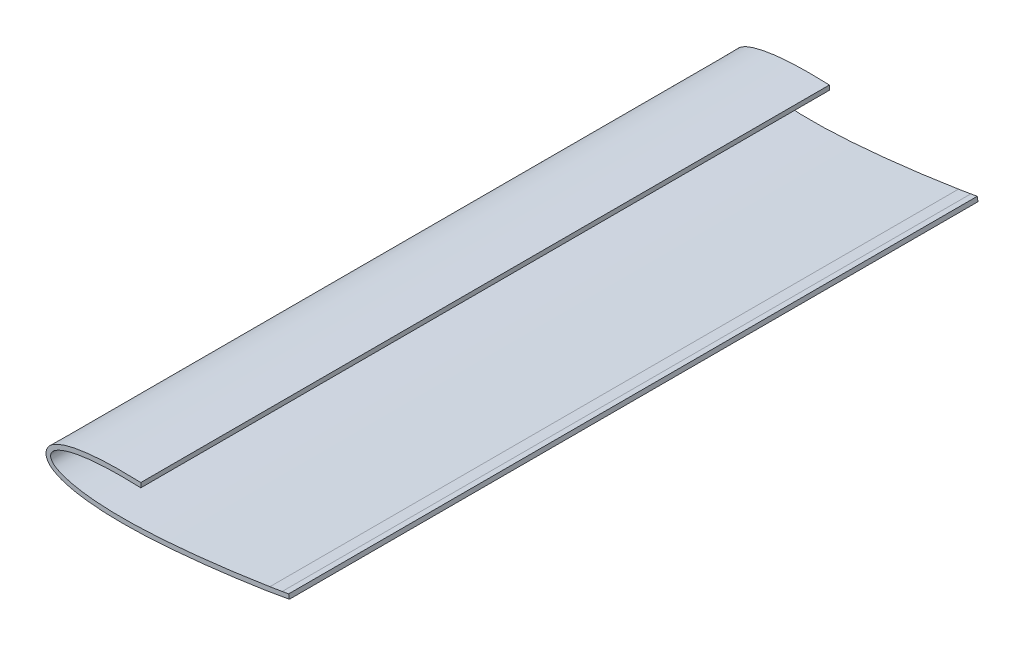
ISO-10303-21;
HEADER;
FILE_DESCRIPTION(('STEP AP214'),'2;1');
FILE_NAME('part.step','',(''),(''),'','','');
FILE_SCHEMA(('AUTOMOTIVE_DESIGN { 1 0 10303 214 1 1 1 1 }'));
ENDSEC;
DATA;
#1=APPLICATION_CONTEXT('core data for automotive mechanical design processes');
#2=APPLICATION_PROTOCOL_DEFINITION('international standard','automotive_design',2000,#1);
#3=PRODUCT_CONTEXT('',#1,'mechanical');
#4=PRODUCT('Part','Part','',(#3));
#5=PRODUCT_RELATED_PRODUCT_CATEGORY('part','',(#4));
#6=PRODUCT_DEFINITION_FORMATION('','',#4);
#7=PRODUCT_DEFINITION_CONTEXT('part definition',#1,'design');
#8=PRODUCT_DEFINITION('design','',#6,#7);
#9=PRODUCT_DEFINITION_SHAPE('','',#8);
#10=(LENGTH_UNIT() NAMED_UNIT(*) SI_UNIT(.MILLI.,.METRE.));
#11=(NAMED_UNIT(*) PLANE_ANGLE_UNIT() SI_UNIT($,.RADIAN.));
#12=(NAMED_UNIT(*) SI_UNIT($,.STERADIAN.) SOLID_ANGLE_UNIT());
#13=UNCERTAINTY_MEASURE_WITH_UNIT(LENGTH_MEASURE(1.E-05),#10,'distance_accuracy_value','');
#14=(GEOMETRIC_REPRESENTATION_CONTEXT(3) GLOBAL_UNCERTAINTY_ASSIGNED_CONTEXT((#13)) GLOBAL_UNIT_ASSIGNED_CONTEXT((#10,
#11,#12)) REPRESENTATION_CONTEXT('',''));
#15=CARTESIAN_POINT('',(0.,0.,0.));
#16=DIRECTION('',(0.,0.,1.));
#17=DIRECTION('',(1.,0.,0.));
#18=AXIS2_PLACEMENT_3D('',#15,#16,#17);
#19=CARTESIAN_POINT('',(51.8585690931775,-1.14149612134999,300.));
#20=CARTESIAN_POINT('',(50.9270444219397,-1.30175657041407,300.));
#21=CARTESIAN_POINT('',(49.9955197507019,-1.46201701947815,300.));
#22=CARTESIAN_POINT('',(49.0637056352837,-1.6205437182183,300.));
#23=B_SPLINE_CURVE_WITH_KNOTS('',3,(#19,#20,#21,#22),.UNSPECIFIED.,.F.,.F.,(4,4),
(0.986199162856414,1.),.UNSPECIFIED.);
#24=DIRECTION('',(0.,0.,-1.));
#25=VECTOR('',#24,1.);
#26=SURFACE_OF_LINEAR_EXTRUSION('',#23,#25);
#27=CARTESIAN_POINT('',(51.8585690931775,-1.14149612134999,0.));
#28=CARTESIAN_POINT('',(50.9270444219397,-1.30175657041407,0.));
#29=CARTESIAN_POINT('',(49.9955197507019,-1.46201701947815,0.));
#30=CARTESIAN_POINT('',(49.0637056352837,-1.6205437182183,0.));
#31=B_SPLINE_CURVE_WITH_KNOTS('',3,(#27,#28,#29,#30),.UNSPECIFIED.,.F.,.F.,(4,4),
(0.986199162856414,1.),.UNSPECIFIED.);
#32=CARTESIAN_POINT('',(51.8585690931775,-1.14149612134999,0.));
#33=VERTEX_POINT('',#32);
#34=CARTESIAN_POINT('',(49.0637056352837,-1.6205437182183,0.));
#35=VERTEX_POINT('',#34);
#36=EDGE_CURVE('E142',#33,#35,#31,.T.);
#37=ORIENTED_EDGE('',*,*,#36,.T.);
#38=DIRECTION('',(0.,0.,-1.));
#39=VECTOR('',#38,1.);
#40=CARTESIAN_POINT('',(49.0637056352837,-1.6205437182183,300.));
#41=LINE('',#40,#39);
#42=CARTESIAN_POINT('',(49.0637056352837,-1.6205437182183,300.));
#43=VERTEX_POINT('',#42);
#44=EDGE_CURVE('E11',#43,#35,#41,.T.);
#45=ORIENTED_EDGE('',*,*,#44,.F.);
#46=CARTESIAN_POINT('',(51.8585690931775,-1.14149612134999,300.));
#47=VERTEX_POINT('',#46);
#48=EDGE_CURVE('E176',#47,#43,#23,.T.);
#49=ORIENTED_EDGE('',*,*,#48,.F.);
#50=DIRECTION('',(0.,0.,-1.));
#51=VECTOR('',#50,1.);
#52=CARTESIAN_POINT('',(51.8585690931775,-1.14149612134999,300.));
#53=LINE('',#52,#51);
#54=EDGE_CURVE('E135',#47,#33,#53,.T.);
#55=ORIENTED_EDGE('',*,*,#54,.T.);
#56=EDGE_LOOP('',(#37,#45,#49,#55));
#57=FACE_BOUND('',#56,.T.);
#58=ADVANCED_FACE('F43',(#57),#26,.F.);
#59=CARTESIAN_POINT('',(43.6918589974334,-2.51831191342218,300.));
#60=DIRECTION('',(0.164838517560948,-0.986320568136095,0.));
#61=DIRECTION('',(0.986320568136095,0.164838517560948,0.));
#62=AXIS2_PLACEMENT_3D('',#59,#60,#61);
#63=PLANE('',#62);
#64=DIRECTION('',(-0.986320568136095,-0.164838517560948,0.));
#65=VECTOR('',#64,1.);
#66=CARTESIAN_POINT('',(43.6918589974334,-2.51831191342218,0.));
#67=LINE('',#66,#65);
#68=CARTESIAN_POINT('',(43.6918589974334,-2.51831191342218,0.));
#69=VERTEX_POINT('',#68);
#70=EDGE_CURVE('E148',#35,#69,#67,.T.);
#71=ORIENTED_EDGE('',*,*,#70,.T.);
#72=DIRECTION('',(0.,0.,-1.));
#73=VECTOR('',#72,1.);
#74=CARTESIAN_POINT('',(43.6918589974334,-2.51831191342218,300.));
#75=LINE('',#74,#73);
#76=CARTESIAN_POINT('',(43.6918589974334,-2.51831191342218,300.));
#77=VERTEX_POINT('',#76);
#78=EDGE_CURVE('E53',#77,#69,#75,.T.);
#79=ORIENTED_EDGE('',*,*,#78,.F.);
#80=DIRECTION('',(-0.986320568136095,-0.164838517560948,0.));
#81=VECTOR('',#80,1.);
#82=CARTESIAN_POINT('',(43.6918589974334,-2.51831191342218,300.));
#83=LINE('',#82,#81);
#84=EDGE_CURVE('E101',#43,#77,#83,.T.);
#85=ORIENTED_EDGE('',*,*,#84,.F.);
#86=ORIENTED_EDGE('',*,*,#44,.T.);
#87=EDGE_LOOP('',(#71,#79,#85,#86));
#88=FACE_BOUND('',#87,.T.);
#89=ADVANCED_FACE('F213',(#88),#63,.F.);
#90=CARTESIAN_POINT('',(43.6918589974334,-2.51831191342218,300.));
#91=CARTESIAN_POINT('',(42.907813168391,-2.64257177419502,300.));
#92=CARTESIAN_POINT('',(38.6766738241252,-3.30325789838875,300.));
#93=CARTESIAN_POINT('',(30.9942527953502,-4.42091125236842,300.));
#94=CARTESIAN_POINT('',(20.6372229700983,-5.7564913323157,300.));
#95=CARTESIAN_POINT('',(10.2814223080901,-6.91328903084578,300.));
#96=CARTESIAN_POINT('',(-0.0742210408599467,-7.85637844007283,300.));
#97=CARTESIAN_POINT('',(-10.431156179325,-8.52257003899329,300.));
#98=CARTESIAN_POINT('',(-19.0686102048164,-8.75077508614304,300.));
#99=CARTESIAN_POINT('',(-25.9753727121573,-8.64786912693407,300.));
#100=CARTESIAN_POINT('',(-31.1580682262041,-8.38518277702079,300.));
#101=CARTESIAN_POINT('',(-36.34756616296,-7.88575404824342,300.));
#102=CARTESIAN_POINT('',(-40.6676166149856,-7.19025575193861,300.));
#103=CARTESIAN_POINT('',(-44.1173996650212,-6.36538393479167,300.));
#104=CARTESIAN_POINT('',(-46.736461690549,-5.53926156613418,300.));
#105=CARTESIAN_POINT('',(-48.9378918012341,-4.53784179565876,300.));
#106=CARTESIAN_POINT('',(-50.9134717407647,-3.21390421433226,300.));
#107=CARTESIAN_POINT('',(-52.4443571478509,-0.893371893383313,300.));
#108=CARTESIAN_POINT('',(-50.9076140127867,1.42328537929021,300.));
#109=CARTESIAN_POINT('',(-48.9286955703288,2.74222761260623,300.));
#110=CARTESIAN_POINT('',(-46.7247424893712,3.73808247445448,300.));
#111=CARTESIAN_POINT('',(-44.1036016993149,4.55758538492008,300.));
#112=CARTESIAN_POINT('',(-40.6517456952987,5.37373900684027,300.));
#113=CARTESIAN_POINT('',(-36.3299519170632,6.05832086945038,300.));
#114=CARTESIAN_POINT('',(-31.1392087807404,6.5446372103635,300.));
#115=CARTESIAN_POINT('',(-25.9558661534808,6.7942291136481,300.));
#116=CARTESIAN_POINT('',(-19.757568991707,6.87091706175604,300.));
#117=CARTESIAN_POINT('',(-15.2877383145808,6.76679805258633,300.));
#118=CARTESIAN_POINT('',(-12.545664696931,6.65784748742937,300.));
#119=B_SPLINE_CURVE_WITH_KNOTS('',3,(#90,#91,#92,#93,#94,#95,#96,#97,#98,#99,#100,#101,#102,
#103,#104,#105,#106,#107,#108,#109,#110,#111,#112,#113,#114,#115,#116,#117,#118),.UNSPECIFIED.,
.F.,.F.,(4,1,1,1,1,1,1,1,1,1,1,1,1,1,1,1,1,1,1,1,1,1,1,1,1,1,4),(0.304211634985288,
0.315405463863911,0.36459757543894,0.413677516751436,0.462653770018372,0.511525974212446,
0.560294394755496,0.608979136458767,0.633316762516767,0.657683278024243,0.682134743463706,
0.706801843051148,0.719318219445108,0.732103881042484,0.74554821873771,0.753047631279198,
0.766075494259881,0.779103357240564,0.786602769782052,0.800047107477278,0.812832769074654,
0.825349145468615,0.850016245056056,0.874467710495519,0.898834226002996,0.923171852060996,
0.961863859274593),.UNSPECIFIED.);
#120=DIRECTION('',(0.,0.,-1.));
#121=VECTOR('',#120,1.);
#122=SURFACE_OF_LINEAR_EXTRUSION('',#119,#121);
#123=CARTESIAN_POINT('',(43.6918589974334,-2.51831191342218,0.));
#124=CARTESIAN_POINT('',(42.907813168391,-2.64257177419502,0.));
#125=CARTESIAN_POINT('',(38.6766738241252,-3.30325789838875,0.));
#126=CARTESIAN_POINT('',(30.9942527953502,-4.42091125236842,0.));
#127=CARTESIAN_POINT('',(20.6372229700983,-5.7564913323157,0.));
#128=CARTESIAN_POINT('',(10.2814223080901,-6.91328903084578,0.));
#129=CARTESIAN_POINT('',(-0.0742210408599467,-7.85637844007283,0.));
#130=CARTESIAN_POINT('',(-10.431156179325,-8.52257003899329,0.));
#131=CARTESIAN_POINT('',(-19.0686102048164,-8.75077508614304,0.));
#132=CARTESIAN_POINT('',(-25.9753727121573,-8.64786912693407,0.));
#133=CARTESIAN_POINT('',(-31.1580682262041,-8.38518277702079,0.));
#134=CARTESIAN_POINT('',(-36.34756616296,-7.88575404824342,0.));
#135=CARTESIAN_POINT('',(-40.6676166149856,-7.19025575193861,0.));
#136=CARTESIAN_POINT('',(-44.1173996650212,-6.36538393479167,0.));
#137=CARTESIAN_POINT('',(-46.736461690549,-5.53926156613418,0.));
#138=CARTESIAN_POINT('',(-48.9378918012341,-4.53784179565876,0.));
#139=CARTESIAN_POINT('',(-50.9134717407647,-3.21390421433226,0.));
#140=CARTESIAN_POINT('',(-52.4443571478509,-0.893371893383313,0.));
#141=CARTESIAN_POINT('',(-50.9076140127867,1.42328537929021,0.));
#142=CARTESIAN_POINT('',(-48.9286955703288,2.74222761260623,0.));
#143=CARTESIAN_POINT('',(-46.7247424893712,3.73808247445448,0.));
#144=CARTESIAN_POINT('',(-44.1036016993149,4.55758538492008,0.));
#145=CARTESIAN_POINT('',(-40.6517456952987,5.37373900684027,0.));
#146=CARTESIAN_POINT('',(-36.3299519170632,6.05832086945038,0.));
#147=CARTESIAN_POINT('',(-31.1392087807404,6.5446372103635,0.));
#148=CARTESIAN_POINT('',(-25.9558661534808,6.7942291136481,0.));
#149=CARTESIAN_POINT('',(-19.757568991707,6.87091706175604,0.));
#150=CARTESIAN_POINT('',(-15.2877383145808,6.76679805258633,0.));
#151=CARTESIAN_POINT('',(-12.545664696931,6.65784748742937,0.));
#152=B_SPLINE_CURVE_WITH_KNOTS('',3,(#123,#124,#125,#126,#127,#128,#129,#130,#131,#132,#133,
#134,#135,#136,#137,#138,#139,#140,#141,#142,#143,#144,#145,#146,#147,#148,#149,#150,#151),
.UNSPECIFIED.,.F.,.F.,(4,1,1,1,1,1,1,1,1,1,1,1,1,1,1,1,1,1,1,1,1,1,1,1,1,1,4),
(0.304211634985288,0.315405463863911,0.36459757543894,0.413677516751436,0.462653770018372,
0.511525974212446,0.560294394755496,0.608979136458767,0.633316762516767,0.657683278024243,
0.682134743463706,0.706801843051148,0.719318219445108,0.732103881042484,0.74554821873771,
0.753047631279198,0.766075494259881,0.779103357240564,0.786602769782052,0.800047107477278,
0.812832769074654,0.825349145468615,0.850016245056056,0.874467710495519,0.898834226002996,
0.923171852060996,0.961863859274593),.UNSPECIFIED.);
#153=CARTESIAN_POINT('',(-12.545664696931,6.65784748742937,0.));
#154=VERTEX_POINT('',#153);
#155=EDGE_CURVE('E154',#69,#154,#152,.T.);
#156=ORIENTED_EDGE('',*,*,#155,.T.);
#157=DIRECTION('',(0.,0.,-1.));
#158=VECTOR('',#157,1.);
#159=CARTESIAN_POINT('',(-12.545664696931,6.65784748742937,300.));
#160=LINE('',#159,#158);
#161=CARTESIAN_POINT('',(-12.545664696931,6.65784748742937,300.));
#162=VERTEX_POINT('',#161);
#163=EDGE_CURVE('E183',#162,#154,#160,.T.);
#164=ORIENTED_EDGE('',*,*,#163,.F.);
#165=EDGE_CURVE('E193',#77,#162,#119,.T.);
#166=ORIENTED_EDGE('',*,*,#165,.F.);
#167=ORIENTED_EDGE('',*,*,#78,.T.);
#168=EDGE_LOOP('',(#156,#164,#166,#167));
#169=FACE_BOUND('',#168,.T.);
#170=ADVANCED_FACE('F191',(#169),#122,.F.);
#171=CARTESIAN_POINT('',(-12.545664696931,8.65932731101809,300.));
#172=DIRECTION('',(-1.,0.,0.));
#173=DIRECTION('',(0.,-1.,0.));
#174=AXIS2_PLACEMENT_3D('',#171,#172,#173);
#175=PLANE('',#174);
#176=DIRECTION('',(0.,1.,0.));
#177=VECTOR('',#176,1.);
#178=CARTESIAN_POINT('',(-12.545664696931,8.65932731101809,0.));
#179=LINE('',#178,#177);
#180=CARTESIAN_POINT('',(-12.545664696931,8.65932731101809,0.));
#181=VERTEX_POINT('',#180);
#182=EDGE_CURVE('E159',#154,#181,#179,.T.);
#183=ORIENTED_EDGE('',*,*,#182,.T.);
#184=DIRECTION('',(0.,0.,-1.));
#185=VECTOR('',#184,1.);
#186=CARTESIAN_POINT('',(-12.545664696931,8.65932731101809,300.));
#187=LINE('',#186,#185);
#188=CARTESIAN_POINT('',(-12.545664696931,8.65932731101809,300.));
#189=VERTEX_POINT('',#188);
#190=EDGE_CURVE('E128',#189,#181,#187,.T.);
#191=ORIENTED_EDGE('',*,*,#190,.F.);
#192=DIRECTION('',(0.,1.,0.));
#193=VECTOR('',#192,1.);
#194=CARTESIAN_POINT('',(-12.545664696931,8.65932731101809,300.));
#195=LINE('',#194,#193);
#196=EDGE_CURVE('E117',#162,#189,#195,.T.);
#197=ORIENTED_EDGE('',*,*,#196,.F.);
#198=ORIENTED_EDGE('',*,*,#163,.T.);
#199=EDGE_LOOP('',(#183,#191,#197,#198));
#200=FACE_BOUND('',#199,.T.);
#201=ADVANCED_FACE('F199',(#200),#175,.F.);
#202=CARTESIAN_POINT('',(-12.545664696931,8.65932731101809,300.));
#203=CARTESIAN_POINT('',(-14.2008130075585,8.72447684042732,300.));
#204=CARTESIAN_POINT('',(-17.985890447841,8.83621686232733,300.));
#205=CARTESIAN_POINT('',(-23.9117300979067,8.85326734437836,300.));
#206=CARTESIAN_POINT('',(-29.2612463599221,8.65942643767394,300.));
#207=CARTESIAN_POINT('',(-33.5466478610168,8.33343930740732,300.));
#208=CARTESIAN_POINT('',(-36.763835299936,7.98484981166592,300.));
#209=CARTESIAN_POINT('',(-39.9863348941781,7.50640839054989,300.));
#210=CARTESIAN_POINT('',(-42.6696695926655,6.96537419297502,300.));
#211=CARTESIAN_POINT('',(-44.811837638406,6.41638808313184,300.));
#212=CARTESIAN_POINT('',(-46.4242178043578,5.92712025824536,300.));
#213=CARTESIAN_POINT('',(-48.0377292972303,5.33212552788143,300.));
#214=CARTESIAN_POINT('',(-49.3867932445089,4.70973377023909,300.));
#215=CARTESIAN_POINT('',(-50.4203016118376,4.13279790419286,300.));
#216=CARTESIAN_POINT('',(-51.2375690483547,3.60556687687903,300.));
#217=CARTESIAN_POINT('',(-52.0795866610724,2.90140860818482,300.));
#218=CARTESIAN_POINT('',(-52.8513105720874,2.02109238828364,300.));
#219=CARTESIAN_POINT('',(-53.4943493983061,0.946512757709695,300.));
#220=CARTESIAN_POINT('',(-53.8354526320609,-0.156378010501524,300.));
#221=CARTESIAN_POINT('',(-53.8623110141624,-1.18469757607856,300.));
#222=CARTESIAN_POINT('',(-53.7050356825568,-2.14033578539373,300.));
#223=CARTESIAN_POINT('',(-53.2779664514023,-3.16288234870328,300.));
#224=CARTESIAN_POINT('',(-52.5810991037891,-4.15858766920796,300.));
#225=CARTESIAN_POINT('',(-51.7757791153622,-4.97816858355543,300.));
#226=CARTESIAN_POINT('',(-50.9333871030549,-5.6128643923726,300.));
#227=CARTESIAN_POINT('',(-49.8834886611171,-6.25107683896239,300.));
#228=CARTESIAN_POINT('',(-48.5615915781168,-6.91300232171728,300.));
#229=CARTESIAN_POINT('',(-46.9432625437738,-7.55531978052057,300.));
#230=CARTESIAN_POINT('',(-45.3314114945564,-8.07845563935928,300.));
#231=CARTESIAN_POINT('',(-43.1907788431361,-8.66078339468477,300.));
#232=CARTESIAN_POINT('',(-40.5096578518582,-9.23434662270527,300.));
#233=CARTESIAN_POINT('',(-37.2877811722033,-9.744936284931,300.));
#234=CARTESIAN_POINT('',(-34.0713679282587,-10.1196491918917,300.));
#235=CARTESIAN_POINT('',(-30.8570446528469,-10.3870656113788,300.));
#236=CARTESIAN_POINT('',(-26.5757641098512,-10.626798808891,300.));
#237=CARTESIAN_POINT('',(-21.2336176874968,-10.7368539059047,300.));
#238=CARTESIAN_POINT('',(-14.8422870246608,-10.6494176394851,300.));
#239=CARTESIAN_POINT('',(-8.4674130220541,-10.3869492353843,300.));
#240=CARTESIAN_POINT('',(-2.11000024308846,-9.98675648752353,300.));
#241=CARTESIAN_POINT('',(6.34532174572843,-9.30521888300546,300.));
#242=CARTESIAN_POINT('',(16.8828224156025,-8.22559608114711,300.));
#243=CARTESIAN_POINT('',(29.4863919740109,-6.65724245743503,300.));
#244=CARTESIAN_POINT('',(37.8675333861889,-5.44756872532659,300.));
#245=CARTESIAN_POINT('',(42.0512425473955,-4.79966867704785,300.));
#246=B_SPLINE_CURVE_WITH_KNOTS('',3,(#202,#203,#204,#205,#206,#207,#208,#209,#210,#211,#212,
#213,#214,#215,#216,#217,#218,#219,#220,#221,#222,#223,#224,#225,#226,#227,#228,#229,#230,#231,
#232,#233,#234,#235,#236,#237,#238,#239,#240,#241,#242,#243,#244,#245),.UNSPECIFIED.,.F.,.F.,(4,
1,1,1,1,1,1,1,1,1,1,1,1,1,1,1,1,1,1,1,1,1,1,1,1,1,1,1,1,1,1,1,1,1,1,1,1,1,1,1,1,4),
(0.304581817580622,0.32775025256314,0.357505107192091,0.387259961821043,0.402137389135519,
0.417014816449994,0.43189224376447,0.446769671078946,0.454208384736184,0.461647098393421,
0.469085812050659,0.476524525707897,0.480243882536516,0.483963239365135,0.487682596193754,
0.491401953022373,0.495121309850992,0.498840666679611,0.50070034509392,0.50256002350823,
0.506279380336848,0.509998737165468,0.513718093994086,0.517437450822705,0.521156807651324,
0.528595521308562,0.5360342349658,0.543472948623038,0.550911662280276,0.565789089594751,
0.580666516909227,0.595543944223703,0.610421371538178,0.625298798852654,0.655053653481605,
0.684808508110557,0.714563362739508,0.74431821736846,0.774073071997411,0.833582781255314,
0.893092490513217,0.952602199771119),.UNSPECIFIED.);
#247=DIRECTION('',(0.,0.,-1.));
#248=VECTOR('',#247,1.);
#249=SURFACE_OF_LINEAR_EXTRUSION('',#246,#248);
#250=CARTESIAN_POINT('',(-12.545664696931,8.65932731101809,0.));
#251=CARTESIAN_POINT('',(-14.2008130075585,8.72447684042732,0.));
#252=CARTESIAN_POINT('',(-17.985890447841,8.83621686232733,0.));
#253=CARTESIAN_POINT('',(-23.9117300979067,8.85326734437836,0.));
#254=CARTESIAN_POINT('',(-29.2612463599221,8.65942643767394,0.));
#255=CARTESIAN_POINT('',(-33.5466478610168,8.33343930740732,0.));
#256=CARTESIAN_POINT('',(-36.763835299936,7.98484981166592,0.));
#257=CARTESIAN_POINT('',(-39.9863348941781,7.50640839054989,0.));
#258=CARTESIAN_POINT('',(-42.6696695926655,6.96537419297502,0.));
#259=CARTESIAN_POINT('',(-44.811837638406,6.41638808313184,0.));
#260=CARTESIAN_POINT('',(-46.4242178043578,5.92712025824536,0.));
#261=CARTESIAN_POINT('',(-48.0377292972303,5.33212552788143,0.));
#262=CARTESIAN_POINT('',(-49.3867932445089,4.70973377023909,0.));
#263=CARTESIAN_POINT('',(-50.4203016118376,4.13279790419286,0.));
#264=CARTESIAN_POINT('',(-51.2375690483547,3.60556687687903,0.));
#265=CARTESIAN_POINT('',(-52.0795866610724,2.90140860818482,0.));
#266=CARTESIAN_POINT('',(-52.8513105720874,2.02109238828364,0.));
#267=CARTESIAN_POINT('',(-53.4943493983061,0.946512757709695,0.));
#268=CARTESIAN_POINT('',(-53.8354526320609,-0.156378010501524,0.));
#269=CARTESIAN_POINT('',(-53.8623110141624,-1.18469757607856,0.));
#270=CARTESIAN_POINT('',(-53.7050356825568,-2.14033578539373,0.));
#271=CARTESIAN_POINT('',(-53.2779664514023,-3.16288234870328,0.));
#272=CARTESIAN_POINT('',(-52.5810991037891,-4.15858766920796,0.));
#273=CARTESIAN_POINT('',(-51.7757791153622,-4.97816858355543,0.));
#274=CARTESIAN_POINT('',(-50.9333871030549,-5.6128643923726,0.));
#275=CARTESIAN_POINT('',(-49.8834886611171,-6.25107683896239,0.));
#276=CARTESIAN_POINT('',(-48.5615915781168,-6.91300232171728,0.));
#277=CARTESIAN_POINT('',(-46.9432625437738,-7.55531978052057,0.));
#278=CARTESIAN_POINT('',(-45.3314114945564,-8.07845563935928,0.));
#279=CARTESIAN_POINT('',(-43.1907788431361,-8.66078339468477,0.));
#280=CARTESIAN_POINT('',(-40.5096578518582,-9.23434662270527,0.));
#281=CARTESIAN_POINT('',(-37.2877811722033,-9.744936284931,0.));
#282=CARTESIAN_POINT('',(-34.0713679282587,-10.1196491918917,0.));
#283=CARTESIAN_POINT('',(-30.8570446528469,-10.3870656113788,0.));
#284=CARTESIAN_POINT('',(-26.5757641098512,-10.626798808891,0.));
#285=CARTESIAN_POINT('',(-21.2336176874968,-10.7368539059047,0.));
#286=CARTESIAN_POINT('',(-14.8422870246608,-10.6494176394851,0.));
#287=CARTESIAN_POINT('',(-8.4674130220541,-10.3869492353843,0.));
#288=CARTESIAN_POINT('',(-2.11000024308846,-9.98675648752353,0.));
#289=CARTESIAN_POINT('',(6.34532174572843,-9.30521888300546,0.));
#290=CARTESIAN_POINT('',(16.8828224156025,-8.22559608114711,0.));
#291=CARTESIAN_POINT('',(29.4863919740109,-6.65724245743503,0.));
#292=CARTESIAN_POINT('',(37.8675333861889,-5.44756872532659,0.));
#293=CARTESIAN_POINT('',(42.0512425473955,-4.79966867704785,0.));
#294=B_SPLINE_CURVE_WITH_KNOTS('',3,(#250,#251,#252,#253,#254,#255,#256,#257,#258,#259,#260,
#261,#262,#263,#264,#265,#266,#267,#268,#269,#270,#271,#272,#273,#274,#275,#276,#277,#278,#279,
#280,#281,#282,#283,#284,#285,#286,#287,#288,#289,#290,#291,#292,#293),.UNSPECIFIED.,.F.,.F.,(4,
1,1,1,1,1,1,1,1,1,1,1,1,1,1,1,1,1,1,1,1,1,1,1,1,1,1,1,1,1,1,1,1,1,1,1,1,1,1,1,1,4),
(0.304581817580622,0.32775025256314,0.357505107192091,0.387259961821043,0.402137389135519,
0.417014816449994,0.43189224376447,0.446769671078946,0.454208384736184,0.461647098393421,
0.469085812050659,0.476524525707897,0.480243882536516,0.483963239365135,0.487682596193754,
0.491401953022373,0.495121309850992,0.498840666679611,0.50070034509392,0.50256002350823,
0.506279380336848,0.509998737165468,0.513718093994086,0.517437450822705,0.521156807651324,
0.528595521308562,0.5360342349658,0.543472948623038,0.550911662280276,0.565789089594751,
0.580666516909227,0.595543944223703,0.610421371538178,0.625298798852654,0.655053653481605,
0.684808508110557,0.714563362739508,0.74431821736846,0.774073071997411,0.833582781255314,
0.893092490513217,0.952602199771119),.UNSPECIFIED.);
#295=CARTESIAN_POINT('',(42.0512425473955,-4.79966867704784,0.));
#296=VERTEX_POINT('',#295);
#297=EDGE_CURVE('E126',#181,#296,#294,.T.);
#298=ORIENTED_EDGE('',*,*,#297,.T.);
#299=DIRECTION('',(0.,0.,-1.));
#300=VECTOR('',#299,1.);
#301=CARTESIAN_POINT('',(42.0512425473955,-4.79966867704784,300.));
#302=LINE('',#301,#300);
#303=CARTESIAN_POINT('',(42.0512425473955,-4.79966867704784,300.));
#304=VERTEX_POINT('',#303);
#305=EDGE_CURVE('E123',#304,#296,#302,.T.);
#306=ORIENTED_EDGE('',*,*,#305,.F.);
#307=EDGE_CURVE('E111',#189,#304,#246,.T.);
#308=ORIENTED_EDGE('',*,*,#307,.F.);
#309=ORIENTED_EDGE('',*,*,#190,.T.);
#310=EDGE_LOOP('',(#298,#306,#308,#309));
#311=FACE_BOUND('',#310,.T.);
#312=ADVANCED_FACE('F124',(#311),#249,.F.);
#313=CARTESIAN_POINT('',(42.0512425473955,-4.79966867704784,300.));
#314=DIRECTION('',(-0.172421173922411,0.985023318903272,0.));
#315=DIRECTION('',(-0.985023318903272,-0.172421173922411,0.));
#316=AXIS2_PLACEMENT_3D('',#313,#314,#315);
#317=PLANE('',#316);
#318=DIRECTION('',(0.985023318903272,0.172421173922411,0.));
#319=VECTOR('',#318,1.);
#320=CARTESIAN_POINT('',(42.0512425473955,-4.79966867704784,0.));
#321=LINE('',#320,#319);
#322=CARTESIAN_POINT('',(52.1883064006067,-3.02524931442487,0.));
#323=VERTEX_POINT('',#322);
#324=EDGE_CURVE('E87',#296,#323,#321,.T.);
#325=ORIENTED_EDGE('',*,*,#324,.T.);
#326=DIRECTION('',(0.,0.,-1.));
#327=VECTOR('',#326,1.);
#328=CARTESIAN_POINT('',(52.1883064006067,-3.02524931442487,300.));
#329=LINE('',#328,#327);
#330=CARTESIAN_POINT('',(52.1883064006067,-3.02524931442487,300.));
#331=VERTEX_POINT('',#330);
#332=EDGE_CURVE('E129',#331,#323,#329,.T.);
#333=ORIENTED_EDGE('',*,*,#332,.F.);
#334=DIRECTION('',(0.985023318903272,0.172421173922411,0.));
#335=VECTOR('',#334,1.);
#336=CARTESIAN_POINT('',(42.0512425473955,-4.79966867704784,300.));
#337=LINE('',#336,#335);
#338=EDGE_CURVE('E115',#304,#331,#337,.T.);
#339=ORIENTED_EDGE('',*,*,#338,.F.);
#340=ORIENTED_EDGE('',*,*,#305,.T.);
#341=EDGE_LOOP('',(#325,#333,#339,#340));
#342=FACE_BOUND('',#341,.T.);
#343=ADVANCED_FACE('F131',(#342),#317,.F.);
#344=CARTESIAN_POINT('',(52.1883064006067,-3.02524931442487,300.));
#345=DIRECTION('',(-0.985023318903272,-0.172421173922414,0.));
#346=DIRECTION('',(0.172421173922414,-0.985023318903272,0.));
#347=AXIS2_PLACEMENT_3D('',#344,#345,#346);
#348=PLANE('',#347);
#349=DIRECTION('',(-0.172421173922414,0.985023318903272,0.));
#350=VECTOR('',#349,1.);
#351=CARTESIAN_POINT('',(52.1883064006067,-3.02524931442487,0.));
#352=LINE('',#351,#350);
#353=EDGE_CURVE('E93',#323,#33,#352,.T.);
#354=ORIENTED_EDGE('',*,*,#353,.T.);
#355=ORIENTED_EDGE('',*,*,#54,.F.);
#356=DIRECTION('',(-0.172421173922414,0.985023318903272,0.));
#357=VECTOR('',#356,1.);
#358=CARTESIAN_POINT('',(52.1883064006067,-3.02524931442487,300.));
#359=LINE('',#358,#357);
#360=EDGE_CURVE('E61',#331,#47,#359,.T.);
#361=ORIENTED_EDGE('',*,*,#360,.F.);
#362=ORIENTED_EDGE('',*,*,#332,.T.);
#363=EDGE_LOOP('',(#354,#355,#361,#362));
#364=FACE_BOUND('',#363,.T.);
#365=ADVANCED_FACE('F222',(#364),#348,.F.);
#366=CARTESIAN_POINT('',(50.4612459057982,-1.38167007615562,300.));
#367=DIRECTION('',(0.,0.,-1.));
#368=DIRECTION('',(-1.,0.,0.));
#369=AXIS2_PLACEMENT_3D('',#366,#367,#368);
#370=PLANE('',#369);
#371=ORIENTED_EDGE('',*,*,#48,.T.);
#372=ORIENTED_EDGE('',*,*,#84,.T.);
#373=ORIENTED_EDGE('',*,*,#165,.T.);
#374=ORIENTED_EDGE('',*,*,#196,.T.);
#375=ORIENTED_EDGE('',*,*,#307,.T.);
#376=ORIENTED_EDGE('',*,*,#338,.T.);
#377=ORIENTED_EDGE('',*,*,#360,.T.);
#378=EDGE_LOOP('',(#371,#372,#373,#374,#375,#376,#377));
#379=FACE_BOUND('',#378,.T.);
#380=ADVANCED_FACE('F113',(#379),#370,.F.);
#381=CARTESIAN_POINT('',(50.4612459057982,-1.38167007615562,0.));
#382=DIRECTION('',(0.,0.,-1.));
#383=DIRECTION('',(-1.,0.,0.));
#384=AXIS2_PLACEMENT_3D('',#381,#382,#383);
#385=PLANE('',#384);
#386=ORIENTED_EDGE('',*,*,#36,.F.);
#387=ORIENTED_EDGE('',*,*,#353,.F.);
#388=ORIENTED_EDGE('',*,*,#324,.F.);
#389=ORIENTED_EDGE('',*,*,#297,.F.);
#390=ORIENTED_EDGE('',*,*,#182,.F.);
#391=ORIENTED_EDGE('',*,*,#155,.F.);
#392=ORIENTED_EDGE('',*,*,#70,.F.);
#393=EDGE_LOOP('',(#386,#387,#388,#389,#390,#391,#392));
#394=FACE_BOUND('',#393,.T.);
#395=ADVANCED_FACE('F197',(#394),#385,.T.);
#396=CLOSED_SHELL('',(#58,#89,#170,#201,#312,#343,#365,#380,#395));
#397=MANIFOLD_SOLID_BREP('B2',#396);
#398=ADVANCED_BREP_SHAPE_REPRESENTATION('',(#18,#397),#14);
#399=SHAPE_DEFINITION_REPRESENTATION(#9,#398);
ENDSEC;
END-ISO-10303-21;
